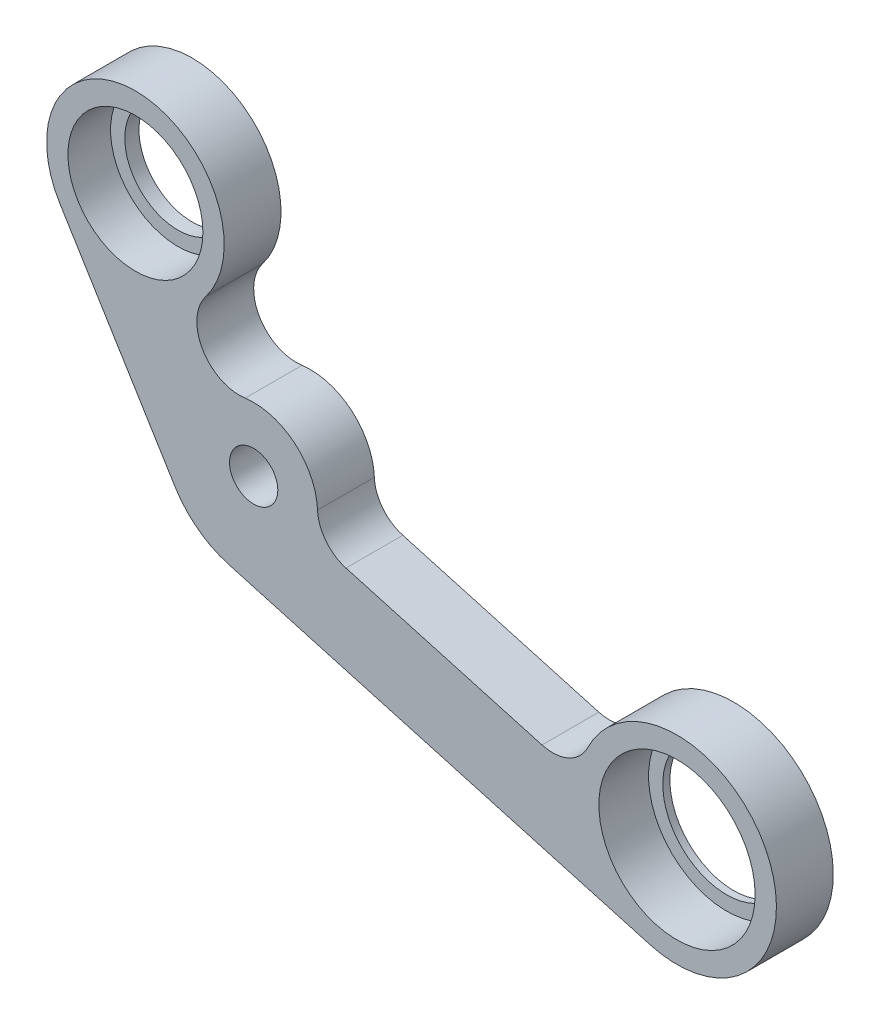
ISO-10303-21;
HEADER;
FILE_DESCRIPTION(('STEP AP214'),'2;1');
FILE_NAME('part.step','',(''),(''),'','','');
FILE_SCHEMA(('AUTOMOTIVE_DESIGN { 1 0 10303 214 1 1 1 1 }'));
ENDSEC;
DATA;
#1=APPLICATION_CONTEXT('core data for automotive mechanical design processes');
#2=APPLICATION_PROTOCOL_DEFINITION('international standard','automotive_design',2000,#1);
#3=PRODUCT_CONTEXT('',#1,'mechanical');
#4=PRODUCT('Part','Part','',(#3));
#5=PRODUCT_RELATED_PRODUCT_CATEGORY('part','',(#4));
#6=PRODUCT_DEFINITION_FORMATION('','',#4);
#7=PRODUCT_DEFINITION_CONTEXT('part definition',#1,'design');
#8=PRODUCT_DEFINITION('design','',#6,#7);
#9=PRODUCT_DEFINITION_SHAPE('','',#8);
#10=(LENGTH_UNIT() NAMED_UNIT(*) SI_UNIT(.MILLI.,.METRE.));
#11=(NAMED_UNIT(*) PLANE_ANGLE_UNIT() SI_UNIT($,.RADIAN.));
#12=(NAMED_UNIT(*) SI_UNIT($,.STERADIAN.) SOLID_ANGLE_UNIT());
#13=UNCERTAINTY_MEASURE_WITH_UNIT(LENGTH_MEASURE(1.E-05),#10,'distance_accuracy_value','');
#14=(GEOMETRIC_REPRESENTATION_CONTEXT(3) GLOBAL_UNCERTAINTY_ASSIGNED_CONTEXT((#13)) GLOBAL_UNIT_ASSIGNED_CONTEXT((#10,
#11,#12)) REPRESENTATION_CONTEXT('',''));
#15=CARTESIAN_POINT('',(0.,0.,0.));
#16=DIRECTION('',(0.,0.,1.));
#17=DIRECTION('',(1.,0.,0.));
#18=AXIS2_PLACEMENT_3D('',#15,#16,#17);
#19=CARTESIAN_POINT('',(-59.10260396,256.225433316,-25.));
#20=DIRECTION('',(0.,0.,1.));
#21=DIRECTION('',(1.,0.,0.));
#22=AXIS2_PLACEMENT_3D('',#19,#20,#21);
#23=CYLINDRICAL_SURFACE('',#22,7.50000000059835);
#24=CARTESIAN_POINT('',(-59.10260396,256.225433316,-25.));
#25=DIRECTION('',(0.,0.,1.));
#26=DIRECTION('',(1.,0.,0.));
#27=AXIS2_PLACEMENT_3D('',#24,#25,#26);
#28=CIRCLE('',#27,7.50000000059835);
#29=CARTESIAN_POINT('',(-51.6026039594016,256.225433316,-25.));
#30=VERTEX_POINT('',#29);
#31=EDGE_CURVE('E36',#30,#30,#28,.F.);
#32=CARTESIAN_POINT('',(-59.10260396,256.225433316,-23.));
#33=DIRECTION('',(0.,0.,1.));
#34=DIRECTION('',(1.,0.,0.));
#35=AXIS2_PLACEMENT_3D('',#32,#33,#34);
#36=CIRCLE('',#35,7.50000000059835);
#37=CARTESIAN_POINT('',(-51.6026039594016,256.225433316,-23.));
#38=VERTEX_POINT('',#37);
#39=EDGE_CURVE('E140',#38,#38,#36,.T.);
#40=CARTESIAN_POINT('',(-51.6026039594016,256.225433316,-25.));
#41=CARTESIAN_POINT('',(-51.6026039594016,256.225433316,-24.9791666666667));
#42=CARTESIAN_POINT('',(-51.6026039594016,256.225433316,-24.9583333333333));
#43=CARTESIAN_POINT('',(-51.6026039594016,256.225433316,-24.9166666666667));
#44=CARTESIAN_POINT('',(-51.6026039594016,256.225433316,-24.8958333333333));
#45=CARTESIAN_POINT('',(-51.6026039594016,256.225433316,-24.8541666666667));
#46=CARTESIAN_POINT('',(-51.6026039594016,256.225433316,-24.8333333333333));
#47=CARTESIAN_POINT('',(-51.6026039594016,256.225433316,-24.7916666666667));
#48=CARTESIAN_POINT('',(-51.6026039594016,256.225433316,-24.7708333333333));
#49=CARTESIAN_POINT('',(-51.6026039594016,256.225433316,-24.7291666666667));
#50=CARTESIAN_POINT('',(-51.6026039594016,256.225433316,-24.7083333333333));
#51=CARTESIAN_POINT('',(-51.6026039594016,256.225433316,-24.6666666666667));
#52=CARTESIAN_POINT('',(-51.6026039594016,256.225433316,-24.6458333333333));
#53=CARTESIAN_POINT('',(-51.6026039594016,256.225433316,-24.6041666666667));
#54=CARTESIAN_POINT('',(-51.6026039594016,256.225433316,-24.5833333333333));
#55=CARTESIAN_POINT('',(-51.6026039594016,256.225433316,-24.5416666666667));
#56=CARTESIAN_POINT('',(-51.6026039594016,256.225433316,-24.5208333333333));
#57=CARTESIAN_POINT('',(-51.6026039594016,256.225433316,-24.4791666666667));
#58=CARTESIAN_POINT('',(-51.6026039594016,256.225433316,-24.4583333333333));
#59=CARTESIAN_POINT('',(-51.6026039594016,256.225433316,-24.4166666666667));
#60=CARTESIAN_POINT('',(-51.6026039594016,256.225433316,-24.3958333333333));
#61=CARTESIAN_POINT('',(-51.6026039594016,256.225433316,-24.3541666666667));
#62=CARTESIAN_POINT('',(-51.6026039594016,256.225433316,-24.3333333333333));
#63=CARTESIAN_POINT('',(-51.6026039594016,256.225433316,-24.2916666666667));
#64=CARTESIAN_POINT('',(-51.6026039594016,256.225433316,-24.2708333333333));
#65=CARTESIAN_POINT('',(-51.6026039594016,256.225433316,-24.2291666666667));
#66=CARTESIAN_POINT('',(-51.6026039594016,256.225433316,-24.2083333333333));
#67=CARTESIAN_POINT('',(-51.6026039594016,256.225433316,-24.1666666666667));
#68=CARTESIAN_POINT('',(-51.6026039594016,256.225433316,-24.1458333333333));
#69=CARTESIAN_POINT('',(-51.6026039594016,256.225433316,-24.1041666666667));
#70=CARTESIAN_POINT('',(-51.6026039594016,256.225433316,-24.0833333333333));
#71=CARTESIAN_POINT('',(-51.6026039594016,256.225433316,-24.0416666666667));
#72=CARTESIAN_POINT('',(-51.6026039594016,256.225433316,-24.0208333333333));
#73=CARTESIAN_POINT('',(-51.6026039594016,256.225433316,-23.9791666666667));
#74=CARTESIAN_POINT('',(-51.6026039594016,256.225433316,-23.9583333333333));
#75=CARTESIAN_POINT('',(-51.6026039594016,256.225433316,-23.9166666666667));
#76=CARTESIAN_POINT('',(-51.6026039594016,256.225433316,-23.8958333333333));
#77=CARTESIAN_POINT('',(-51.6026039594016,256.225433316,-23.8541666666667));
#78=CARTESIAN_POINT('',(-51.6026039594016,256.225433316,-23.8333333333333));
#79=CARTESIAN_POINT('',(-51.6026039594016,256.225433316,-23.7916666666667));
#80=CARTESIAN_POINT('',(-51.6026039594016,256.225433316,-23.7708333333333));
#81=CARTESIAN_POINT('',(-51.6026039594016,256.225433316,-23.7291666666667));
#82=CARTESIAN_POINT('',(-51.6026039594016,256.225433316,-23.7083333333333));
#83=CARTESIAN_POINT('',(-51.6026039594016,256.225433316,-23.6666666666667));
#84=CARTESIAN_POINT('',(-51.6026039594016,256.225433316,-23.6458333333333));
#85=CARTESIAN_POINT('',(-51.6026039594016,256.225433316,-23.6041666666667));
#86=CARTESIAN_POINT('',(-51.6026039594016,256.225433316,-23.5833333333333));
#87=CARTESIAN_POINT('',(-51.6026039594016,256.225433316,-23.5416666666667));
#88=CARTESIAN_POINT('',(-51.6026039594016,256.225433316,-23.5208333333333));
#89=CARTESIAN_POINT('',(-51.6026039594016,256.225433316,-23.4791666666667));
#90=CARTESIAN_POINT('',(-51.6026039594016,256.225433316,-23.4583333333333));
#91=CARTESIAN_POINT('',(-51.6026039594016,256.225433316,-23.4166666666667));
#92=CARTESIAN_POINT('',(-51.6026039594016,256.225433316,-23.3958333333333));
#93=CARTESIAN_POINT('',(-51.6026039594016,256.225433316,-23.3541666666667));
#94=CARTESIAN_POINT('',(-51.6026039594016,256.225433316,-23.3333333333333));
#95=CARTESIAN_POINT('',(-51.6026039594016,256.225433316,-23.2916666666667));
#96=CARTESIAN_POINT('',(-51.6026039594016,256.225433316,-23.2708333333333));
#97=CARTESIAN_POINT('',(-51.6026039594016,256.225433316,-23.2291666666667));
#98=CARTESIAN_POINT('',(-51.6026039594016,256.225433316,-23.2083333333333));
#99=CARTESIAN_POINT('',(-51.6026039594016,256.225433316,-23.1666666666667));
#100=CARTESIAN_POINT('',(-51.6026039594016,256.225433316,-23.1458333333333));
#101=CARTESIAN_POINT('',(-51.6026039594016,256.225433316,-23.1041666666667));
#102=CARTESIAN_POINT('',(-51.6026039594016,256.225433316,-23.0833333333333));
#103=CARTESIAN_POINT('',(-51.6026039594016,256.225433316,-23.0416666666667));
#104=CARTESIAN_POINT('',(-51.6026039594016,256.225433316,-23.0208333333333));
#105=CARTESIAN_POINT('',(-51.6026039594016,256.225433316,-23.));
#106=B_SPLINE_CURVE_WITH_KNOTS('',3,(#40,#41,#42,#43,#44,#45,#46,#47,#48,#49,#50,#51,#52,#53,
#54,#55,#56,#57,#58,#59,#60,#61,#62,#63,#64,#65,#66,#67,#68,#69,#70,#71,#72,#73,#74,#75,#76,#77,
#78,#79,#80,#81,#82,#83,#84,#85,#86,#87,#88,#89,#90,#91,#92,#93,#94,#95,#96,#97,#98,#99,#100,
#101,#102,#103,#104,#105),.UNSPECIFIED.,.F.,.F.,(4,2,2,2,2,2,2,2,2,2,2,2,2,2,2,2,2,2,2,2,2,2,2,
2,2,2,2,2,2,2,2,2,4),(0.,0.0625000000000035,0.125000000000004,0.187500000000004,
0.250000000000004,0.312500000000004,0.375000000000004,0.437500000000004,0.500000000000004,
0.562500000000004,0.625000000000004,0.687500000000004,0.750000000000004,0.812500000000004,
0.875000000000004,0.937500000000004,1.,1.0625,1.125,1.1875,1.25,1.3125,1.375,1.4375,1.5,1.5625,
1.625,1.6875,1.75000000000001,1.81250000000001,1.87500000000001,1.93750000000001,
2.00000000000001),.UNSPECIFIED.);
#107=EDGE_CURVE('BSEAM32',#30,#38,#106,.T.);
#108=ORIENTED_EDGE('',*,*,#31,.T.);
#109=ORIENTED_EDGE('',*,*,#39,.T.);
#110=ORIENTED_EDGE('',*,*,#107,.T.);
#111=ORIENTED_EDGE('',*,*,#107,.F.);
#112=EDGE_LOOP('',(#108,#110,#109,#111));
#113=FACE_BOUND('',#112,.T.);
#114=ADVANCED_FACE('F32',(#113),#23,.F.);
#115=CARTESIAN_POINT('',(16.439924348,182.567015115,-25.));
#116=DIRECTION('',(0.,0.,1.));
#117=DIRECTION('',(0.481671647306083,0.876351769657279,0.));
#118=AXIS2_PLACEMENT_3D('',#115,#116,#117);
#119=PLANE('',#118);
#120=CARTESIAN_POINT('',(-42.457488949,230.060145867,-25.));
#121=DIRECTION('',(0.,0.,1.));
#122=DIRECTION('',(1.,0.,0.));
#123=AXIS2_PLACEMENT_3D('',#120,#121,#122);
#124=CIRCLE('',#123,3.4);
#125=CARTESIAN_POINT('',(-39.057488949,230.060145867,-25.));
#126=VERTEX_POINT('',#125);
#127=EDGE_CURVE('E145',#126,#126,#124,.T.);
#128=ORIENTED_EDGE('',*,*,#127,.T.);
#129=EDGE_LOOP('',(#128));
#130=FACE_BOUND('',#129,.T.);
#131=CARTESIAN_POINT('',(17.14,214.32,-25.));
#132=DIRECTION('',(0.,0.,1.));
#133=DIRECTION('',(1.,0.,0.));
#134=AXIS2_PLACEMENT_3D('',#131,#132,#133);
#135=CIRCLE('',#134,9.00000000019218);
#136=CARTESIAN_POINT('',(26.1400000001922,214.32,-25.));
#137=VERTEX_POINT('',#136);
#138=EDGE_CURVE('E119',#137,#137,#135,.F.);
#139=ORIENTED_EDGE('',*,*,#138,.F.);
#140=EDGE_LOOP('',(#139));
#141=FACE_BOUND('',#140,.T.);
#142=ORIENTED_EDGE('',*,*,#31,.F.);
#143=EDGE_LOOP('',(#142));
#144=FACE_BOUND('',#143,.T.);
#145=DIRECTION('',(-0.962578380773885,0.271003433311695,0.));
#146=VECTOR('',#145,1.);
#147=CARTESIAN_POINT('',(-16.317290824,209.195264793,-25.));
#148=LINE('',#147,#146);
#149=CARTESIAN_POINT('',(13.3459519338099,200.843902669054,-25.));
#150=VERTEX_POINT('',#149);
#151=CARTESIAN_POINT('',(-45.9805335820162,217.546626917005,-25.));
#152=VERTEX_POINT('',#151);
#153=EDGE_CURVE('E159',#150,#152,#148,.T.);
#154=ORIENTED_EDGE('',*,*,#153,.T.);
#155=CARTESIAN_POINT('',(-42.457488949,230.060145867,-25.));
#156=DIRECTION('',(0.,0.,1.));
#157=DIRECTION('',(1.,0.,0.));
#158=AXIS2_PLACEMENT_3D('',#155,#156,#157);
#159=CIRCLE('',#158,13.0000000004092);
#160=CARTESIAN_POINT('',(-53.5372151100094,223.260170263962,-25.));
#161=VERTEX_POINT('',#160);
#162=EDGE_CURVE('E164',#152,#161,#159,.F.);
#163=ORIENTED_EDGE('',*,*,#162,.T.);
#164=DIRECTION('',(-0.52307504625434,0.852286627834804,0.));
#165=VECTOR('',#164,1.);
#166=CARTESIAN_POINT('',(-61.6467009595,236.473582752,-25.));
#167=LINE('',#166,#165);
#168=CARTESIAN_POINT('',(-69.7561868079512,249.686995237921,-25.));
#169=VERTEX_POINT('',#168);
#170=EDGE_CURVE('E168',#161,#169,#167,.T.);
#171=ORIENTED_EDGE('',*,*,#170,.T.);
#172=CARTESIAN_POINT('',(-59.10260396,256.225433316,-25.));
#173=DIRECTION('',(0.,0.,1.));
#174=DIRECTION('',(1.,0.,0.));
#175=AXIS2_PLACEMENT_3D('',#172,#173,#174);
#176=CIRCLE('',#175,12.5000000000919);
#177=CARTESIAN_POINT('',(-49.2047273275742,248.5911659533,-25.));
#178=VERTEX_POINT('',#177);
#179=EDGE_CURVE('E172',#169,#178,#176,.F.);
#180=ORIENTED_EDGE('',*,*,#179,.T.);
#181=CARTESIAN_POINT('',(-44.453746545,244.926717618,-25.));
#182=DIRECTION('',(0.,0.,1.));
#183=DIRECTION('',(1.,0.,0.));
#184=AXIS2_PLACEMENT_3D('',#181,#182,#183);
#185=CIRCLE('',#184,6.00000000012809);
#186=CARTESIAN_POINT('',(-43.655243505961,238.980088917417,-25.));
#187=VERTEX_POINT('',#186);
#188=EDGE_CURVE('E173',#187,#178,#185,.F.);
#189=ORIENTED_EDGE('',*,*,#188,.F.);
#190=CARTESIAN_POINT('',(-42.457488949,230.060145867,-25.));
#191=DIRECTION('',(0.,0.,1.));
#192=DIRECTION('',(1.,0.,0.));
#193=AXIS2_PLACEMENT_3D('',#190,#191,#192);
#194=CIRCLE('',#193,8.99999999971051);
#195=CARTESIAN_POINT('',(-33.4650968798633,230.430125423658,-25.));
#196=VERTEX_POINT('',#195);
#197=EDGE_CURVE('E177',#187,#196,#194,.F.);
#198=ORIENTED_EDGE('',*,*,#197,.T.);
#199=CARTESIAN_POINT('',(-27.969746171,230.656224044,-25.));
#200=DIRECTION('',(0.,0.,1.));
#201=DIRECTION('',(1.,0.,0.));
#202=AXIS2_PLACEMENT_3D('',#199,#200,#201);
#203=CIRCLE('',#202,5.49999999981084);
#204=CARTESIAN_POINT('',(-29.4602650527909,225.362042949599,-25.));
#205=VERTEX_POINT('',#204);
#206=EDGE_CURVE('E136',#205,#196,#203,.F.);
#207=ORIENTED_EDGE('',*,*,#206,.F.);
#208=DIRECTION('',(0.962578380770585,-0.271003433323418,0.));
#209=VECTOR('',#208,1.);
#210=CARTESIAN_POINT('',(-15.6638634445,221.477816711,-25.));
#211=LINE('',#210,#209);
#212=CARTESIAN_POINT('',(-1.86746183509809,217.593590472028,-25.));
#213=VERTEX_POINT('',#212);
#214=EDGE_CURVE('E131',#205,#213,#211,.T.);
#215=ORIENTED_EDGE('',*,*,#214,.T.);
#216=CARTESIAN_POINT('',(-0.376942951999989,222.887771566,-25.));
#217=DIRECTION('',(0.,0.,1.));
#218=DIRECTION('',(1.,0.,0.));
#219=AXIS2_PLACEMENT_3D('',#216,#217,#218);
#220=CIRCLE('',#219,5.49999999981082);
#221=CARTESIAN_POINT('',(4.5637332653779,220.471220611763,-25.));
#222=VERTEX_POINT('',#221);
#223=EDGE_CURVE('E124',#222,#213,#220,.F.);
#224=ORIENTED_EDGE('',*,*,#223,.F.);
#225=CARTESIAN_POINT('',(17.14,214.32,-25.));
#226=DIRECTION('',(0.,0.,1.));
#227=DIRECTION('',(1.,0.,0.));
#228=AXIS2_PLACEMENT_3D('',#225,#226,#227);
#229=CIRCLE('',#228,13.9999999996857);
#230=EDGE_CURVE('E108',#222,#150,#229,.F.);
#231=ORIENTED_EDGE('',*,*,#230,.T.);
#232=EDGE_LOOP('',(#154,#163,#171,#180,#189,#198,#207,#215,#224,#231));
#233=FACE_BOUND('',#232,.T.);
#234=ADVANCED_FACE('F129',(#130,#141,#144,#233),#119,.F.);
#235=CARTESIAN_POINT('',(-46.046566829,260.019888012,-23.));
#236=DIRECTION('',(0.,0.,-1.));
#237=DIRECTION('',(-0.481671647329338,-0.876351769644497,0.));
#238=AXIS2_PLACEMENT_3D('',#235,#236,#237);
#239=PLANE('',#238);
#240=ORIENTED_EDGE('',*,*,#39,.F.);
#241=EDGE_LOOP('',(#240));
#242=FACE_BOUND('',#241,.T.);
#243=CARTESIAN_POINT('',(-59.10260396,256.225433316,-23.));
#244=DIRECTION('',(0.,0.,1.));
#245=DIRECTION('',(1.,0.,0.));
#246=AXIS2_PLACEMENT_3D('',#243,#244,#245);
#247=CIRCLE('',#246,9.50000000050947);
#248=CARTESIAN_POINT('',(-49.6026039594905,256.225433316,-23.));
#249=VERTEX_POINT('',#248);
#250=EDGE_CURVE('E158',#249,#249,#247,.F.);
#251=ORIENTED_EDGE('',*,*,#250,.F.);
#252=EDGE_LOOP('',(#251));
#253=FACE_BOUND('',#252,.T.);
#254=ADVANCED_FACE('F265',(#242,#253),#239,.F.);
#255=CARTESIAN_POINT('',(17.14,214.32,-25.));
#256=DIRECTION('',(0.,0.,1.));
#257=DIRECTION('',(1.,0.,0.));
#258=AXIS2_PLACEMENT_3D('',#255,#256,#257);
#259=CYLINDRICAL_SURFACE('',#258,9.00000000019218);
#260=CARTESIAN_POINT('',(17.14,214.32,-24.));
#261=DIRECTION('',(0.,0.,1.));
#262=DIRECTION('',(1.,0.,0.));
#263=AXIS2_PLACEMENT_3D('',#260,#261,#262);
#264=CIRCLE('',#263,9.00000000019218);
#265=CARTESIAN_POINT('',(26.1400000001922,214.32,-24.));
#266=VERTEX_POINT('',#265);
#267=EDGE_CURVE('E213',#266,#266,#264,.F.);
#268=CARTESIAN_POINT('',(26.1400000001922,214.32,-24.));
#269=CARTESIAN_POINT('',(26.1400000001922,214.32,-24.0104166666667));
#270=CARTESIAN_POINT('',(26.1400000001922,214.32,-24.0208333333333));
#271=CARTESIAN_POINT('',(26.1400000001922,214.32,-24.0416666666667));
#272=CARTESIAN_POINT('',(26.1400000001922,214.32,-24.0520833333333));
#273=CARTESIAN_POINT('',(26.1400000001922,214.32,-24.0729166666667));
#274=CARTESIAN_POINT('',(26.1400000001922,214.32,-24.0833333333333));
#275=CARTESIAN_POINT('',(26.1400000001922,214.32,-24.1041666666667));
#276=CARTESIAN_POINT('',(26.1400000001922,214.32,-24.1145833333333));
#277=CARTESIAN_POINT('',(26.1400000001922,214.32,-24.1354166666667));
#278=CARTESIAN_POINT('',(26.1400000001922,214.32,-24.1458333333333));
#279=CARTESIAN_POINT('',(26.1400000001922,214.32,-24.1666666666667));
#280=CARTESIAN_POINT('',(26.1400000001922,214.32,-24.1770833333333));
#281=CARTESIAN_POINT('',(26.1400000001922,214.32,-24.1979166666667));
#282=CARTESIAN_POINT('',(26.1400000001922,214.32,-24.2083333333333));
#283=CARTESIAN_POINT('',(26.1400000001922,214.32,-24.2291666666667));
#284=CARTESIAN_POINT('',(26.1400000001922,214.32,-24.2395833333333));
#285=CARTESIAN_POINT('',(26.1400000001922,214.32,-24.2604166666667));
#286=CARTESIAN_POINT('',(26.1400000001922,214.32,-24.2708333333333));
#287=CARTESIAN_POINT('',(26.1400000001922,214.32,-24.2916666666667));
#288=CARTESIAN_POINT('',(26.1400000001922,214.32,-24.3020833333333));
#289=CARTESIAN_POINT('',(26.1400000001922,214.32,-24.3229166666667));
#290=CARTESIAN_POINT('',(26.1400000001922,214.32,-24.3333333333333));
#291=CARTESIAN_POINT('',(26.1400000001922,214.32,-24.3541666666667));
#292=CARTESIAN_POINT('',(26.1400000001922,214.32,-24.3645833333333));
#293=CARTESIAN_POINT('',(26.1400000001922,214.32,-24.3854166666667));
#294=CARTESIAN_POINT('',(26.1400000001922,214.32,-24.3958333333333));
#295=CARTESIAN_POINT('',(26.1400000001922,214.32,-24.4166666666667));
#296=CARTESIAN_POINT('',(26.1400000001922,214.32,-24.4270833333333));
#297=CARTESIAN_POINT('',(26.1400000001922,214.32,-24.4479166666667));
#298=CARTESIAN_POINT('',(26.1400000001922,214.32,-24.4583333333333));
#299=CARTESIAN_POINT('',(26.1400000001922,214.32,-24.4791666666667));
#300=CARTESIAN_POINT('',(26.1400000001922,214.32,-24.4895833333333));
#301=CARTESIAN_POINT('',(26.1400000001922,214.32,-24.5104166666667));
#302=CARTESIAN_POINT('',(26.1400000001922,214.32,-24.5208333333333));
#303=CARTESIAN_POINT('',(26.1400000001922,214.32,-24.5416666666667));
#304=CARTESIAN_POINT('',(26.1400000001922,214.32,-24.5520833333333));
#305=CARTESIAN_POINT('',(26.1400000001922,214.32,-24.5729166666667));
#306=CARTESIAN_POINT('',(26.1400000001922,214.32,-24.5833333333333));
#307=CARTESIAN_POINT('',(26.1400000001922,214.32,-24.6041666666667));
#308=CARTESIAN_POINT('',(26.1400000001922,214.32,-24.6145833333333));
#309=CARTESIAN_POINT('',(26.1400000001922,214.32,-24.6354166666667));
#310=CARTESIAN_POINT('',(26.1400000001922,214.32,-24.6458333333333));
#311=CARTESIAN_POINT('',(26.1400000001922,214.32,-24.6666666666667));
#312=CARTESIAN_POINT('',(26.1400000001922,214.32,-24.6770833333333));
#313=CARTESIAN_POINT('',(26.1400000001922,214.32,-24.6979166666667));
#314=CARTESIAN_POINT('',(26.1400000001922,214.32,-24.7083333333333));
#315=CARTESIAN_POINT('',(26.1400000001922,214.32,-24.7291666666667));
#316=CARTESIAN_POINT('',(26.1400000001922,214.32,-24.7395833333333));
#317=CARTESIAN_POINT('',(26.1400000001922,214.32,-24.7604166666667));
#318=CARTESIAN_POINT('',(26.1400000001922,214.32,-24.7708333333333));
#319=CARTESIAN_POINT('',(26.1400000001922,214.32,-24.7916666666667));
#320=CARTESIAN_POINT('',(26.1400000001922,214.32,-24.8020833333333));
#321=CARTESIAN_POINT('',(26.1400000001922,214.32,-24.8229166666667));
#322=CARTESIAN_POINT('',(26.1400000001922,214.32,-24.8333333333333));
#323=CARTESIAN_POINT('',(26.1400000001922,214.32,-24.8541666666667));
#324=CARTESIAN_POINT('',(26.1400000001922,214.32,-24.8645833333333));
#325=CARTESIAN_POINT('',(26.1400000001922,214.32,-24.8854166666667));
#326=CARTESIAN_POINT('',(26.1400000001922,214.32,-24.8958333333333));
#327=CARTESIAN_POINT('',(26.1400000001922,214.32,-24.9166666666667));
#328=CARTESIAN_POINT('',(26.1400000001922,214.32,-24.9270833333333));
#329=CARTESIAN_POINT('',(26.1400000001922,214.32,-24.9479166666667));
#330=CARTESIAN_POINT('',(26.1400000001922,214.32,-24.9583333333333));
#331=CARTESIAN_POINT('',(26.1400000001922,214.32,-24.9791666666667));
#332=CARTESIAN_POINT('',(26.1400000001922,214.32,-24.9895833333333));
#333=CARTESIAN_POINT('',(26.1400000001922,214.32,-25.));
#334=B_SPLINE_CURVE_WITH_KNOTS('',3,(#268,#269,#270,#271,#272,#273,#274,#275,#276,#277,#278,
#279,#280,#281,#282,#283,#284,#285,#286,#287,#288,#289,#290,#291,#292,#293,#294,#295,#296,#297,
#298,#299,#300,#301,#302,#303,#304,#305,#306,#307,#308,#309,#310,#311,#312,#313,#314,#315,#316,
#317,#318,#319,#320,#321,#322,#323,#324,#325,#326,#327,#328,#329,#330,#331,#332,#333),
.UNSPECIFIED.,.F.,.F.,(4,2,2,2,2,2,2,2,2,2,2,2,2,2,2,2,2,2,2,2,2,2,2,2,2,2,2,2,2,2,2,2,4),(0.,
0.03125,0.0625000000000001,0.0937500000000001,0.125,0.15625,0.1875,0.21875,0.25,0.28125,0.3125,
0.343750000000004,0.375,0.406250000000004,0.4375,0.468750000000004,0.5,0.53125,0.5625,
0.593750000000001,0.625000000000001,0.656250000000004,0.687500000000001,0.718750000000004,
0.750000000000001,0.781250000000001,0.812500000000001,0.843750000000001,0.875000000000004,
0.906250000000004,0.937500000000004,0.968750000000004,1.),.UNSPECIFIED.);
#335=EDGE_CURVE('BSEAM267',#266,#137,#334,.T.);
#336=ORIENTED_EDGE('',*,*,#267,.F.);
#337=ORIENTED_EDGE('',*,*,#138,.T.);
#338=ORIENTED_EDGE('',*,*,#335,.T.);
#339=ORIENTED_EDGE('',*,*,#335,.F.);
#340=EDGE_LOOP('',(#336,#338,#337,#339));
#341=FACE_BOUND('',#340,.T.);
#342=ADVANCED_FACE('F267',(#341),#259,.F.);
#343=CARTESIAN_POINT('',(17.14,214.32,-25.));
#344=DIRECTION('',(0.,0.,1.));
#345=DIRECTION('',(1.,0.,0.));
#346=AXIS2_PLACEMENT_3D('',#343,#344,#345);
#347=CYLINDRICAL_SURFACE('',#346,13.9999999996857);
#348=ORIENTED_EDGE('',*,*,#230,.F.);
#349=DIRECTION('',(0.,0.,1.));
#350=VECTOR('',#349,1.);
#351=CARTESIAN_POINT('',(4.56373326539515,220.471220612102,-21.));
#352=LINE('',#351,#350);
#353=CARTESIAN_POINT('',(4.5637332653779,220.471220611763,-17.));
#354=VERTEX_POINT('',#353);
#355=EDGE_CURVE('E111',#354,#222,#352,.F.);
#356=ORIENTED_EDGE('',*,*,#355,.F.);
#357=CARTESIAN_POINT('',(17.14,214.32,-17.));
#358=DIRECTION('',(0.,0.,1.));
#359=DIRECTION('',(1.,0.,0.));
#360=AXIS2_PLACEMENT_3D('',#357,#358,#359);
#361=CIRCLE('',#360,13.9999999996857);
#362=CARTESIAN_POINT('',(13.3459519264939,200.843902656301,-17.));
#363=VERTEX_POINT('',#362);
#364=EDGE_CURVE('E211',#363,#354,#361,.T.);
#365=ORIENTED_EDGE('',*,*,#364,.F.);
#366=DIRECTION('',(0.,0.,-1.));
#367=VECTOR('',#366,1.);
#368=CARTESIAN_POINT('',(13.345951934,200.843902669,-21.));
#369=LINE('',#368,#367);
#370=EDGE_CURVE('E114',#363,#150,#369,.T.);
#371=ORIENTED_EDGE('',*,*,#370,.T.);
#372=EDGE_LOOP('',(#348,#356,#365,#371));
#373=FACE_BOUND('',#372,.T.);
#374=ADVANCED_FACE('F110',(#373),#347,.T.);
#375=CARTESIAN_POINT('',(-0.376942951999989,222.887771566,-25.));
#376=DIRECTION('',(0.,0.,1.));
#377=DIRECTION('',(1.,0.,0.));
#378=AXIS2_PLACEMENT_3D('',#375,#376,#377);
#379=CYLINDRICAL_SURFACE('',#378,5.49999999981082);
#380=ORIENTED_EDGE('',*,*,#223,.T.);
#381=DIRECTION('',(0.,0.,1.));
#382=VECTOR('',#381,1.);
#383=CARTESIAN_POINT('',(-1.867461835,217.593590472,-21.));
#384=LINE('',#383,#382);
#385=CARTESIAN_POINT('',(-1.86746183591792,217.593590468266,-17.));
#386=VERTEX_POINT('',#385);
#387=EDGE_CURVE('E133',#213,#386,#384,.T.);
#388=ORIENTED_EDGE('',*,*,#387,.T.);
#389=CARTESIAN_POINT('',(-0.376942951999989,222.887771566,-17.));
#390=DIRECTION('',(0.,0.,1.));
#391=DIRECTION('',(1.,0.,0.));
#392=AXIS2_PLACEMENT_3D('',#389,#390,#391);
#393=CIRCLE('',#392,5.49999999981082);
#394=EDGE_CURVE('E126',#354,#386,#393,.F.);
#395=ORIENTED_EDGE('',*,*,#394,.F.);
#396=ORIENTED_EDGE('',*,*,#355,.T.);
#397=EDGE_LOOP('',(#380,#388,#395,#396));
#398=FACE_BOUND('',#397,.T.);
#399=ADVANCED_FACE('F122',(#398),#379,.F.);
#400=CARTESIAN_POINT('',(-1.867461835,217.593590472,-17.));
#401=DIRECTION('',(-0.271003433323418,-0.962578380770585,0.));
#402=DIRECTION('',(-0.962578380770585,0.271003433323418,0.));
#403=AXIS2_PLACEMENT_3D('',#400,#401,#402);
#404=PLANE('',#403);
#405=ORIENTED_EDGE('',*,*,#387,.F.);
#406=ORIENTED_EDGE('',*,*,#214,.F.);
#407=DIRECTION('',(0.,0.,1.));
#408=VECTOR('',#407,1.);
#409=CARTESIAN_POINT('',(-29.4602650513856,225.362042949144,-21.));
#410=LINE('',#409,#408);
#411=CARTESIAN_POINT('',(-29.460265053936,225.362042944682,-17.));
#412=VERTEX_POINT('',#411);
#413=EDGE_CURVE('E181',#412,#205,#410,.F.);
#414=ORIENTED_EDGE('',*,*,#413,.F.);
#415=DIRECTION('',(-0.96257838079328,0.271003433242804,0.));
#416=VECTOR('',#415,1.);
#417=CARTESIAN_POINT('',(-1.86746182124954,217.593590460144,-17.));
#418=LINE('',#417,#416);
#419=EDGE_CURVE('E208',#386,#412,#418,.T.);
#420=ORIENTED_EDGE('',*,*,#419,.F.);
#421=EDGE_LOOP('',(#405,#406,#414,#420));
#422=FACE_BOUND('',#421,.T.);
#423=ADVANCED_FACE('F235',(#422),#404,.F.);
#424=CARTESIAN_POINT('',(-27.969746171,230.656224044,-25.));
#425=DIRECTION('',(0.,0.,1.));
#426=DIRECTION('',(1.,0.,0.));
#427=AXIS2_PLACEMENT_3D('',#424,#425,#426);
#428=CYLINDRICAL_SURFACE('',#427,5.49999999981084);
#429=ORIENTED_EDGE('',*,*,#206,.T.);
#430=DIRECTION('',(0.,0.,-1.));
#431=VECTOR('',#430,1.);
#432=CARTESIAN_POINT('',(-33.4650968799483,230.430125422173,-21.));
#433=LINE('',#432,#431);
#434=CARTESIAN_POINT('',(-33.4650968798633,230.430125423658,-17.));
#435=VERTEX_POINT('',#434);
#436=EDGE_CURVE('E178',#196,#435,#433,.F.);
#437=ORIENTED_EDGE('',*,*,#436,.T.);
#438=CARTESIAN_POINT('',(-27.969746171,230.656224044,-17.));
#439=DIRECTION('',(0.,0.,1.));
#440=DIRECTION('',(1.,0.,0.));
#441=AXIS2_PLACEMENT_3D('',#438,#439,#440);
#442=CIRCLE('',#441,5.49999999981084);
#443=EDGE_CURVE('E205',#412,#435,#442,.F.);
#444=ORIENTED_EDGE('',*,*,#443,.F.);
#445=ORIENTED_EDGE('',*,*,#413,.T.);
#446=EDGE_LOOP('',(#429,#437,#444,#445));
#447=FACE_BOUND('',#446,.T.);
#448=ADVANCED_FACE('F228',(#447),#428,.F.);
#449=CARTESIAN_POINT('',(-42.457488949,230.060145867,-25.));
#450=DIRECTION('',(0.,0.,1.));
#451=DIRECTION('',(1.,0.,0.));
#452=AXIS2_PLACEMENT_3D('',#449,#450,#451);
#453=CYLINDRICAL_SURFACE('',#452,8.99999999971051);
#454=ORIENTED_EDGE('',*,*,#197,.F.);
#455=DIRECTION('',(0.,0.,1.));
#456=VECTOR('',#455,1.);
#457=CARTESIAN_POINT('',(-43.6552435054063,238.980088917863,-21.));
#458=LINE('',#457,#456);
#459=CARTESIAN_POINT('',(-43.655243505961,238.980088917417,-17.));
#460=VERTEX_POINT('',#459);
#461=EDGE_CURVE('E174',#460,#187,#458,.F.);
#462=ORIENTED_EDGE('',*,*,#461,.F.);
#463=CARTESIAN_POINT('',(-42.457488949,230.060145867,-17.));
#464=DIRECTION('',(0.,0.,1.));
#465=DIRECTION('',(1.,0.,0.));
#466=AXIS2_PLACEMENT_3D('',#463,#464,#465);
#467=CIRCLE('',#466,8.99999999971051);
#468=EDGE_CURVE('E203',#435,#460,#467,.T.);
#469=ORIENTED_EDGE('',*,*,#468,.F.);
#470=ORIENTED_EDGE('',*,*,#436,.F.);
#471=EDGE_LOOP('',(#454,#462,#469,#470));
#472=FACE_BOUND('',#471,.T.);
#473=ADVANCED_FACE('F231',(#472),#453,.T.);
#474=CARTESIAN_POINT('',(-44.453746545,244.926717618,-25.));
#475=DIRECTION('',(0.,0.,1.));
#476=DIRECTION('',(1.,0.,0.));
#477=AXIS2_PLACEMENT_3D('',#474,#475,#476);
#478=CYLINDRICAL_SURFACE('',#477,6.00000000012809);
#479=ORIENTED_EDGE('',*,*,#188,.T.);
#480=DIRECTION('',(0.,0.,-1.));
#481=VECTOR('',#480,1.);
#482=CARTESIAN_POINT('',(-49.2047273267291,248.591165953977,-21.));
#483=LINE('',#482,#481);
#484=CARTESIAN_POINT('',(-49.2047273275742,248.5911659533,-17.));
#485=VERTEX_POINT('',#484);
#486=EDGE_CURVE('E169',#178,#485,#483,.F.);
#487=ORIENTED_EDGE('',*,*,#486,.T.);
#488=CARTESIAN_POINT('',(-44.453746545,244.926717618,-17.));
#489=DIRECTION('',(0.,0.,1.));
#490=DIRECTION('',(1.,0.,0.));
#491=AXIS2_PLACEMENT_3D('',#488,#489,#490);
#492=CIRCLE('',#491,6.00000000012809);
#493=EDGE_CURVE('E200',#460,#485,#492,.F.);
#494=ORIENTED_EDGE('',*,*,#493,.F.);
#495=ORIENTED_EDGE('',*,*,#461,.T.);
#496=EDGE_LOOP('',(#479,#487,#494,#495));
#497=FACE_BOUND('',#496,.T.);
#498=ADVANCED_FACE('F304',(#497),#478,.F.);
#499=CARTESIAN_POINT('',(-59.10260396,256.225433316,-25.));
#500=DIRECTION('',(0.,0.,1.));
#501=DIRECTION('',(1.,0.,0.));
#502=AXIS2_PLACEMENT_3D('',#499,#500,#501);
#503=CYLINDRICAL_SURFACE('',#502,12.5000000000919);
#504=ORIENTED_EDGE('',*,*,#179,.F.);
#505=DIRECTION('',(0.,0.,1.));
#506=VECTOR('',#505,1.);
#507=CARTESIAN_POINT('',(-69.756186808,249.686995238,-21.));
#508=LINE('',#507,#506);
#509=CARTESIAN_POINT('',(-69.7561867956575,249.686995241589,-17.));
#510=VERTEX_POINT('',#509);
#511=EDGE_CURVE('E165',#169,#510,#508,.T.);
#512=ORIENTED_EDGE('',*,*,#511,.T.);
#513=CARTESIAN_POINT('',(-59.10260396,256.225433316,-17.));
#514=DIRECTION('',(0.,0.,1.));
#515=DIRECTION('',(1.,0.,0.));
#516=AXIS2_PLACEMENT_3D('',#513,#514,#515);
#517=CIRCLE('',#516,12.5000000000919);
#518=EDGE_CURVE('E198',#485,#510,#517,.T.);
#519=ORIENTED_EDGE('',*,*,#518,.F.);
#520=ORIENTED_EDGE('',*,*,#486,.F.);
#521=EDGE_LOOP('',(#504,#512,#519,#520));
#522=FACE_BOUND('',#521,.T.);
#523=ADVANCED_FACE('F299',(#522),#503,.T.);
#524=CARTESIAN_POINT('',(-69.756186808,249.686995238,-17.));
#525=DIRECTION('',(0.852286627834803,0.523075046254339,0.));
#526=DIRECTION('',(0.523075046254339,-0.852286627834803,0.));
#527=AXIS2_PLACEMENT_3D('',#524,#525,#526);
#528=PLANE('',#527);
#529=ORIENTED_EDGE('',*,*,#511,.F.);
#530=ORIENTED_EDGE('',*,*,#170,.F.);
#531=DIRECTION('',(0.,0.,-1.));
#532=VECTOR('',#531,1.);
#533=CARTESIAN_POINT('',(-53.5372151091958,223.260170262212,-21.));
#534=LINE('',#533,#532);
#535=CARTESIAN_POINT('',(-53.5372150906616,223.260170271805,-17.));
#536=VERTEX_POINT('',#535);
#537=EDGE_CURVE('E161',#161,#536,#534,.F.);
#538=ORIENTED_EDGE('',*,*,#537,.T.);
#539=DIRECTION('',(0.523075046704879,-0.852286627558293,0.));
#540=VECTOR('',#539,1.);
#541=CARTESIAN_POINT('',(-69.7561867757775,249.686995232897,-17.));
#542=LINE('',#541,#540);
#543=EDGE_CURVE('E196',#510,#536,#542,.T.);
#544=ORIENTED_EDGE('',*,*,#543,.F.);
#545=EDGE_LOOP('',(#529,#530,#538,#544));
#546=FACE_BOUND('',#545,.T.);
#547=ADVANCED_FACE('F295',(#546),#528,.F.);
#548=CARTESIAN_POINT('',(-42.457488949,230.060145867,-25.));
#549=DIRECTION('',(0.,0.,1.));
#550=DIRECTION('',(1.,0.,0.));
#551=AXIS2_PLACEMENT_3D('',#548,#549,#550);
#552=CYLINDRICAL_SURFACE('',#551,13.0000000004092);
#553=ORIENTED_EDGE('',*,*,#537,.F.);
#554=ORIENTED_EDGE('',*,*,#162,.F.);
#555=DIRECTION('',(0.,0.,1.));
#556=VECTOR('',#555,1.);
#557=CARTESIAN_POINT('',(-45.980533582,217.546626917,-21.));
#558=LINE('',#557,#556);
#559=CARTESIAN_POINT('',(-45.980533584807,217.54662691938,-17.));
#560=VERTEX_POINT('',#559);
#561=EDGE_CURVE('E156',#152,#560,#558,.T.);
#562=ORIENTED_EDGE('',*,*,#561,.T.);
#563=CARTESIAN_POINT('',(-42.457488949,230.060145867,-17.));
#564=DIRECTION('',(0.,0.,1.));
#565=DIRECTION('',(1.,0.,0.));
#566=AXIS2_PLACEMENT_3D('',#563,#564,#565);
#567=CIRCLE('',#566,13.0000000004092);
#568=EDGE_CURVE('E51',#536,#560,#567,.T.);
#569=ORIENTED_EDGE('',*,*,#568,.F.);
#570=EDGE_LOOP('',(#553,#554,#562,#569));
#571=FACE_BOUND('',#570,.T.);
#572=ADVANCED_FACE('F289',(#571),#552,.T.);
#573=CARTESIAN_POINT('',(-45.980533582,217.546626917,-17.));
#574=DIRECTION('',(0.271003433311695,0.962578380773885,0.));
#575=DIRECTION('',(0.962578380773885,-0.271003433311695,0.));
#576=AXIS2_PLACEMENT_3D('',#573,#574,#575);
#577=PLANE('',#576);
#578=ORIENTED_EDGE('',*,*,#561,.F.);
#579=ORIENTED_EDGE('',*,*,#153,.F.);
#580=ORIENTED_EDGE('',*,*,#370,.F.);
#581=DIRECTION('',(0.962578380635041,-0.271003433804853,0.));
#582=VECTOR('',#581,1.);
#583=CARTESIAN_POINT('',(-45.9805335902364,217.546626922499,-17.));
#584=LINE('',#583,#582);
#585=EDGE_CURVE('E193',#560,#363,#584,.T.);
#586=ORIENTED_EDGE('',*,*,#585,.F.);
#587=EDGE_LOOP('',(#578,#579,#580,#586));
#588=FACE_BOUND('',#587,.T.);
#589=ADVANCED_FACE('F279',(#588),#577,.F.);
#590=CARTESIAN_POINT('',(-59.10260396,256.225433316,-23.));
#591=DIRECTION('',(0.,0.,1.));
#592=DIRECTION('',(1.,0.,0.));
#593=AXIS2_PLACEMENT_3D('',#590,#591,#592);
#594=CYLINDRICAL_SURFACE('',#593,9.50000000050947);
#595=CARTESIAN_POINT('',(-59.10260396,256.225433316,-17.));
#596=DIRECTION('',(0.,0.,1.));
#597=DIRECTION('',(1.,0.,0.));
#598=AXIS2_PLACEMENT_3D('',#595,#596,#597);
#599=CIRCLE('',#598,9.50000000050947);
#600=CARTESIAN_POINT('',(-49.6026039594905,256.225433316,-17.));
#601=VERTEX_POINT('',#600);
#602=EDGE_CURVE('E190',#601,#601,#599,.F.);
#603=CARTESIAN_POINT('',(-49.6026039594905,256.225433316,-23.));
#604=CARTESIAN_POINT('',(-49.6026039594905,256.225433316,-22.9375));
#605=CARTESIAN_POINT('',(-49.6026039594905,256.225433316,-22.875));
#606=CARTESIAN_POINT('',(-49.6026039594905,256.225433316,-22.75));
#607=CARTESIAN_POINT('',(-49.6026039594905,256.225433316,-22.6875));
#608=CARTESIAN_POINT('',(-49.6026039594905,256.225433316,-22.5625));
#609=CARTESIAN_POINT('',(-49.6026039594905,256.225433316,-22.5));
#610=CARTESIAN_POINT('',(-49.6026039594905,256.225433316,-22.375));
#611=CARTESIAN_POINT('',(-49.6026039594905,256.225433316,-22.3125));
#612=CARTESIAN_POINT('',(-49.6026039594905,256.225433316,-22.1875));
#613=CARTESIAN_POINT('',(-49.6026039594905,256.225433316,-22.125));
#614=CARTESIAN_POINT('',(-49.6026039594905,256.225433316,-22.));
#615=CARTESIAN_POINT('',(-49.6026039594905,256.225433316,-21.9375));
#616=CARTESIAN_POINT('',(-49.6026039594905,256.225433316,-21.8125));
#617=CARTESIAN_POINT('',(-49.6026039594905,256.225433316,-21.75));
#618=CARTESIAN_POINT('',(-49.6026039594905,256.225433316,-21.625));
#619=CARTESIAN_POINT('',(-49.6026039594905,256.225433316,-21.5625));
#620=CARTESIAN_POINT('',(-49.6026039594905,256.225433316,-21.4375));
#621=CARTESIAN_POINT('',(-49.6026039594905,256.225433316,-21.375));
#622=CARTESIAN_POINT('',(-49.6026039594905,256.225433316,-21.25));
#623=CARTESIAN_POINT('',(-49.6026039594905,256.225433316,-21.1875));
#624=CARTESIAN_POINT('',(-49.6026039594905,256.225433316,-21.0625));
#625=CARTESIAN_POINT('',(-49.6026039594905,256.225433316,-21.));
#626=CARTESIAN_POINT('',(-49.6026039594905,256.225433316,-20.875));
#627=CARTESIAN_POINT('',(-49.6026039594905,256.225433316,-20.8125));
#628=CARTESIAN_POINT('',(-49.6026039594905,256.225433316,-20.6875));
#629=CARTESIAN_POINT('',(-49.6026039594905,256.225433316,-20.625));
#630=CARTESIAN_POINT('',(-49.6026039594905,256.225433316,-20.5));
#631=CARTESIAN_POINT('',(-49.6026039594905,256.225433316,-20.4375));
#632=CARTESIAN_POINT('',(-49.6026039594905,256.225433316,-20.3125));
#633=CARTESIAN_POINT('',(-49.6026039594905,256.225433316,-20.25));
#634=CARTESIAN_POINT('',(-49.6026039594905,256.225433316,-20.125));
#635=CARTESIAN_POINT('',(-49.6026039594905,256.225433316,-20.0625));
#636=CARTESIAN_POINT('',(-49.6026039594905,256.225433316,-19.9375));
#637=CARTESIAN_POINT('',(-49.6026039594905,256.225433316,-19.875));
#638=CARTESIAN_POINT('',(-49.6026039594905,256.225433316,-19.75));
#639=CARTESIAN_POINT('',(-49.6026039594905,256.225433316,-19.6875));
#640=CARTESIAN_POINT('',(-49.6026039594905,256.225433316,-19.5625));
#641=CARTESIAN_POINT('',(-49.6026039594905,256.225433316,-19.5));
#642=CARTESIAN_POINT('',(-49.6026039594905,256.225433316,-19.375));
#643=CARTESIAN_POINT('',(-49.6026039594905,256.225433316,-19.3125));
#644=CARTESIAN_POINT('',(-49.6026039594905,256.225433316,-19.1875));
#645=CARTESIAN_POINT('',(-49.6026039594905,256.225433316,-19.125));
#646=CARTESIAN_POINT('',(-49.6026039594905,256.225433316,-19.));
#647=CARTESIAN_POINT('',(-49.6026039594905,256.225433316,-18.9375));
#648=CARTESIAN_POINT('',(-49.6026039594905,256.225433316,-18.8125));
#649=CARTESIAN_POINT('',(-49.6026039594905,256.225433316,-18.75));
#650=CARTESIAN_POINT('',(-49.6026039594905,256.225433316,-18.625));
#651=CARTESIAN_POINT('',(-49.6026039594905,256.225433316,-18.5625));
#652=CARTESIAN_POINT('',(-49.6026039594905,256.225433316,-18.4375));
#653=CARTESIAN_POINT('',(-49.6026039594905,256.225433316,-18.375));
#654=CARTESIAN_POINT('',(-49.6026039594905,256.225433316,-18.25));
#655=CARTESIAN_POINT('',(-49.6026039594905,256.225433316,-18.1875));
#656=CARTESIAN_POINT('',(-49.6026039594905,256.225433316,-18.0625));
#657=CARTESIAN_POINT('',(-49.6026039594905,256.225433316,-18.));
#658=CARTESIAN_POINT('',(-49.6026039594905,256.225433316,-17.875));
#659=CARTESIAN_POINT('',(-49.6026039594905,256.225433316,-17.8125));
#660=CARTESIAN_POINT('',(-49.6026039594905,256.225433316,-17.6875));
#661=CARTESIAN_POINT('',(-49.6026039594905,256.225433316,-17.625));
#662=CARTESIAN_POINT('',(-49.6026039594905,256.225433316,-17.5));
#663=CARTESIAN_POINT('',(-49.6026039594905,256.225433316,-17.4375));
#664=CARTESIAN_POINT('',(-49.6026039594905,256.225433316,-17.3125));
#665=CARTESIAN_POINT('',(-49.6026039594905,256.225433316,-17.25));
#666=CARTESIAN_POINT('',(-49.6026039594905,256.225433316,-17.125));
#667=CARTESIAN_POINT('',(-49.6026039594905,256.225433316,-17.0625));
#668=CARTESIAN_POINT('',(-49.6026039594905,256.225433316,-17.));
#669=B_SPLINE_CURVE_WITH_KNOTS('',3,(#603,#604,#605,#606,#607,#608,#609,#610,#611,#612,#613,
#614,#615,#616,#617,#618,#619,#620,#621,#622,#623,#624,#625,#626,#627,#628,#629,#630,#631,#632,
#633,#634,#635,#636,#637,#638,#639,#640,#641,#642,#643,#644,#645,#646,#647,#648,#649,#650,#651,
#652,#653,#654,#655,#656,#657,#658,#659,#660,#661,#662,#663,#664,#665,#666,#667,#668),
.UNSPECIFIED.,.F.,.F.,(4,2,2,2,2,2,2,2,2,2,2,2,2,2,2,2,2,2,2,2,2,2,2,2,2,2,2,2,2,2,2,2,4),(0.,
0.1875,0.375,0.5625,0.750000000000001,0.937500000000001,1.125,1.3125,1.5,1.6875,1.875,2.0625,
2.25,2.4375,2.625,2.8125,3.,3.1875,3.375,3.5625,3.75,3.9375,4.125,4.3125,4.5,4.6875,4.875,
5.0625,5.25,5.4375,5.625,5.8125,6.),.UNSPECIFIED.);
#670=EDGE_CURVE('BSEAM262',#249,#601,#669,.T.);
#671=ORIENTED_EDGE('',*,*,#250,.T.);
#672=ORIENTED_EDGE('',*,*,#602,.F.);
#673=ORIENTED_EDGE('',*,*,#670,.T.);
#674=ORIENTED_EDGE('',*,*,#670,.F.);
#675=EDGE_LOOP('',(#671,#673,#672,#674));
#676=FACE_BOUND('',#675,.T.);
#677=ADVANCED_FACE('F262',(#676),#594,.F.);
#678=CARTESIAN_POINT('',(21.533579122,199.202483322,-24.));
#679=DIRECTION('',(0.,0.,1.));
#680=DIRECTION('',(0.481671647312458,0.876351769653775,0.));
#681=AXIS2_PLACEMENT_3D('',#678,#679,#680);
#682=PLANE('',#681);
#683=ORIENTED_EDGE('',*,*,#267,.T.);
#684=EDGE_LOOP('',(#683));
#685=FACE_BOUND('',#684,.T.);
#686=CARTESIAN_POINT('',(17.14,214.32,-24.));
#687=DIRECTION('',(0.,0.,1.));
#688=DIRECTION('',(1.,0.,0.));
#689=AXIS2_PLACEMENT_3D('',#686,#687,#688);
#690=CIRCLE('',#689,10.9999999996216);
#691=CARTESIAN_POINT('',(28.1399999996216,214.32,-24.));
#692=VERTEX_POINT('',#691);
#693=EDGE_CURVE('E42',#692,#692,#690,.F.);
#694=ORIENTED_EDGE('',*,*,#693,.F.);
#695=EDGE_LOOP('',(#694));
#696=FACE_BOUND('',#695,.T.);
#697=ADVANCED_FACE('F257',(#685,#696),#682,.T.);
#698=CARTESIAN_POINT('',(16.439924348,182.567015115,-17.));
#699=DIRECTION('',(0.,0.,1.));
#700=DIRECTION('',(0.481671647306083,0.876351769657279,0.));
#701=AXIS2_PLACEMENT_3D('',#698,#699,#700);
#702=PLANE('',#701);
#703=CARTESIAN_POINT('',(-42.457488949,230.060145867,-17.));
#704=DIRECTION('',(0.,0.,1.));
#705=DIRECTION('',(1.,0.,0.));
#706=AXIS2_PLACEMENT_3D('',#703,#704,#705);
#707=CIRCLE('',#706,3.39999999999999);
#708=CARTESIAN_POINT('',(-39.057488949,230.060145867,-17.));
#709=VERTEX_POINT('',#708);
#710=EDGE_CURVE('E149',#709,#709,#707,.T.);
#711=ORIENTED_EDGE('',*,*,#710,.F.);
#712=EDGE_LOOP('',(#711));
#713=FACE_BOUND('',#712,.T.);
#714=ORIENTED_EDGE('',*,*,#602,.T.);
#715=EDGE_LOOP('',(#714));
#716=FACE_BOUND('',#715,.T.);
#717=CARTESIAN_POINT('',(17.14,214.32,-17.));
#718=DIRECTION('',(0.,0.,1.));
#719=DIRECTION('',(1.,0.,0.));
#720=AXIS2_PLACEMENT_3D('',#717,#718,#719);
#721=CIRCLE('',#720,10.9999999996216);
#722=CARTESIAN_POINT('',(28.1399999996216,214.32,-17.));
#723=VERTEX_POINT('',#722);
#724=EDGE_CURVE('E11',#723,#723,#721,.T.);
#725=ORIENTED_EDGE('',*,*,#724,.F.);
#726=EDGE_LOOP('',(#725));
#727=FACE_BOUND('',#726,.T.);
#728=ORIENTED_EDGE('',*,*,#568,.T.);
#729=ORIENTED_EDGE('',*,*,#585,.T.);
#730=ORIENTED_EDGE('',*,*,#364,.T.);
#731=ORIENTED_EDGE('',*,*,#394,.T.);
#732=ORIENTED_EDGE('',*,*,#419,.T.);
#733=ORIENTED_EDGE('',*,*,#443,.T.);
#734=ORIENTED_EDGE('',*,*,#468,.T.);
#735=ORIENTED_EDGE('',*,*,#493,.T.);
#736=ORIENTED_EDGE('',*,*,#518,.T.);
#737=ORIENTED_EDGE('',*,*,#543,.T.);
#738=EDGE_LOOP('',(#728,#729,#730,#731,#732,#733,#734,#735,#736,#737));
#739=FACE_BOUND('',#738,.T.);
#740=ADVANCED_FACE('F34',(#713,#716,#727,#739),#702,.T.);
#741=CARTESIAN_POINT('',(17.14,214.32,-24.));
#742=DIRECTION('',(0.,0.,1.));
#743=DIRECTION('',(1.,0.,0.));
#744=AXIS2_PLACEMENT_3D('',#741,#742,#743);
#745=CYLINDRICAL_SURFACE('',#744,10.9999999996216);
#746=CARTESIAN_POINT('',(28.1399999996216,214.32,-17.));
#747=CARTESIAN_POINT('',(28.1399999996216,214.32,-17.0729166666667));
#748=CARTESIAN_POINT('',(28.1399999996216,214.32,-17.1458333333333));
#749=CARTESIAN_POINT('',(28.1399999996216,214.32,-17.2916666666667));
#750=CARTESIAN_POINT('',(28.1399999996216,214.32,-17.3645833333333));
#751=CARTESIAN_POINT('',(28.1399999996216,214.32,-17.5104166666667));
#752=CARTESIAN_POINT('',(28.1399999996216,214.32,-17.5833333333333));
#753=CARTESIAN_POINT('',(28.1399999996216,214.32,-17.7291666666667));
#754=CARTESIAN_POINT('',(28.1399999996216,214.32,-17.8020833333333));
#755=CARTESIAN_POINT('',(28.1399999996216,214.32,-17.9479166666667));
#756=CARTESIAN_POINT('',(28.1399999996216,214.32,-18.0208333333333));
#757=CARTESIAN_POINT('',(28.1399999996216,214.32,-18.1666666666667));
#758=CARTESIAN_POINT('',(28.1399999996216,214.32,-18.2395833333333));
#759=CARTESIAN_POINT('',(28.1399999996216,214.32,-18.3854166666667));
#760=CARTESIAN_POINT('',(28.1399999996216,214.32,-18.4583333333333));
#761=CARTESIAN_POINT('',(28.1399999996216,214.32,-18.6041666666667));
#762=CARTESIAN_POINT('',(28.1399999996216,214.32,-18.6770833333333));
#763=CARTESIAN_POINT('',(28.1399999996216,214.32,-18.8229166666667));
#764=CARTESIAN_POINT('',(28.1399999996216,214.32,-18.8958333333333));
#765=CARTESIAN_POINT('',(28.1399999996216,214.32,-19.0416666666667));
#766=CARTESIAN_POINT('',(28.1399999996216,214.32,-19.1145833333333));
#767=CARTESIAN_POINT('',(28.1399999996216,214.32,-19.2604166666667));
#768=CARTESIAN_POINT('',(28.1399999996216,214.32,-19.3333333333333));
#769=CARTESIAN_POINT('',(28.1399999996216,214.32,-19.4791666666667));
#770=CARTESIAN_POINT('',(28.1399999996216,214.32,-19.5520833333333));
#771=CARTESIAN_POINT('',(28.1399999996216,214.32,-19.6979166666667));
#772=CARTESIAN_POINT('',(28.1399999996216,214.32,-19.7708333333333));
#773=CARTESIAN_POINT('',(28.1399999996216,214.32,-19.9166666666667));
#774=CARTESIAN_POINT('',(28.1399999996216,214.32,-19.9895833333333));
#775=CARTESIAN_POINT('',(28.1399999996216,214.32,-20.1354166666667));
#776=CARTESIAN_POINT('',(28.1399999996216,214.32,-20.2083333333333));
#777=CARTESIAN_POINT('',(28.1399999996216,214.32,-20.3541666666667));
#778=CARTESIAN_POINT('',(28.1399999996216,214.32,-20.4270833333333));
#779=CARTESIAN_POINT('',(28.1399999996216,214.32,-20.5729166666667));
#780=CARTESIAN_POINT('',(28.1399999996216,214.32,-20.6458333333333));
#781=CARTESIAN_POINT('',(28.1399999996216,214.32,-20.7916666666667));
#782=CARTESIAN_POINT('',(28.1399999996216,214.32,-20.8645833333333));
#783=CARTESIAN_POINT('',(28.1399999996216,214.32,-21.0104166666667));
#784=CARTESIAN_POINT('',(28.1399999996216,214.32,-21.0833333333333));
#785=CARTESIAN_POINT('',(28.1399999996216,214.32,-21.2291666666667));
#786=CARTESIAN_POINT('',(28.1399999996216,214.32,-21.3020833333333));
#787=CARTESIAN_POINT('',(28.1399999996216,214.32,-21.4479166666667));
#788=CARTESIAN_POINT('',(28.1399999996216,214.32,-21.5208333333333));
#789=CARTESIAN_POINT('',(28.1399999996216,214.32,-21.6666666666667));
#790=CARTESIAN_POINT('',(28.1399999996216,214.32,-21.7395833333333));
#791=CARTESIAN_POINT('',(28.1399999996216,214.32,-21.8854166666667));
#792=CARTESIAN_POINT('',(28.1399999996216,214.32,-21.9583333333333));
#793=CARTESIAN_POINT('',(28.1399999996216,214.32,-22.1041666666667));
#794=CARTESIAN_POINT('',(28.1399999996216,214.32,-22.1770833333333));
#795=CARTESIAN_POINT('',(28.1399999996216,214.32,-22.3229166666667));
#796=CARTESIAN_POINT('',(28.1399999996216,214.32,-22.3958333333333));
#797=CARTESIAN_POINT('',(28.1399999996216,214.32,-22.5416666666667));
#798=CARTESIAN_POINT('',(28.1399999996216,214.32,-22.6145833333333));
#799=CARTESIAN_POINT('',(28.1399999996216,214.32,-22.7604166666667));
#800=CARTESIAN_POINT('',(28.1399999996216,214.32,-22.8333333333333));
#801=CARTESIAN_POINT('',(28.1399999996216,214.32,-22.9791666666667));
#802=CARTESIAN_POINT('',(28.1399999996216,214.32,-23.0520833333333));
#803=CARTESIAN_POINT('',(28.1399999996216,214.32,-23.1979166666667));
#804=CARTESIAN_POINT('',(28.1399999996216,214.32,-23.2708333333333));
#805=CARTESIAN_POINT('',(28.1399999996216,214.32,-23.4166666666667));
#806=CARTESIAN_POINT('',(28.1399999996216,214.32,-23.4895833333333));
#807=CARTESIAN_POINT('',(28.1399999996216,214.32,-23.6354166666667));
#808=CARTESIAN_POINT('',(28.1399999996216,214.32,-23.7083333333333));
#809=CARTESIAN_POINT('',(28.1399999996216,214.32,-23.8541666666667));
#810=CARTESIAN_POINT('',(28.1399999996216,214.32,-23.9270833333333));
#811=CARTESIAN_POINT('',(28.1399999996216,214.32,-24.));
#812=B_SPLINE_CURVE_WITH_KNOTS('',3,(#746,#747,#748,#749,#750,#751,#752,#753,#754,#755,#756,
#757,#758,#759,#760,#761,#762,#763,#764,#765,#766,#767,#768,#769,#770,#771,#772,#773,#774,#775,
#776,#777,#778,#779,#780,#781,#782,#783,#784,#785,#786,#787,#788,#789,#790,#791,#792,#793,#794,
#795,#796,#797,#798,#799,#800,#801,#802,#803,#804,#805,#806,#807,#808,#809,#810,#811),
.UNSPECIFIED.,.F.,.F.,(4,2,2,2,2,2,2,2,2,2,2,2,2,2,2,2,2,2,2,2,2,2,2,2,2,2,2,2,2,2,2,2,4),(0.,
0.21875,0.4375,0.656250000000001,0.874999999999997,1.09375,1.3125,1.53125,1.75,1.96875,2.1875,
2.40625,2.625,2.84375,3.0625,3.28125,3.5,3.71875,3.9375,4.15625,4.375,4.59375,4.8125,5.03125,
5.25,5.46875,5.6875,5.90625,6.125,6.34375,6.5625,6.78125,7.),.UNSPECIFIED.);
#813=EDGE_CURVE('BSEAM246',#723,#692,#812,.T.);
#814=ORIENTED_EDGE('',*,*,#724,.T.);
#815=ORIENTED_EDGE('',*,*,#693,.T.);
#816=ORIENTED_EDGE('',*,*,#813,.T.);
#817=ORIENTED_EDGE('',*,*,#813,.F.);
#818=EDGE_LOOP('',(#814,#816,#815,#817));
#819=FACE_BOUND('',#818,.T.);
#820=ADVANCED_FACE('F246',(#819),#745,.F.);
#821=CARTESIAN_POINT('',(-42.457488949,230.060145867,-17.));
#822=DIRECTION('',(0.,0.,1.));
#823=DIRECTION('',(1.,0.,0.));
#824=AXIS2_PLACEMENT_3D('',#821,#822,#823);
#825=CYLINDRICAL_SURFACE('',#824,3.39999999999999);
#826=ORIENTED_EDGE('',*,*,#127,.F.);
#827=EDGE_LOOP('',(#826));
#828=FACE_BOUND('',#827,.T.);
#829=ORIENTED_EDGE('',*,*,#710,.T.);
#830=EDGE_LOOP('',(#829));
#831=FACE_BOUND('',#830,.T.);
#832=ADVANCED_FACE('F248',(#828,#831),#825,.F.);
#833=CLOSED_SHELL('',(#114,#234,#254,#342,#374,#399,#423,#448,#473,#498,#523,#547,#572,#589,
#677,#697,#740,#820,#832));
#834=MANIFOLD_SOLID_BREP('B2',#833);
#835=ADVANCED_BREP_SHAPE_REPRESENTATION('',(#18,#834),#14);
#836=SHAPE_DEFINITION_REPRESENTATION(#9,#835);
ENDSEC;
END-ISO-10303-21;
